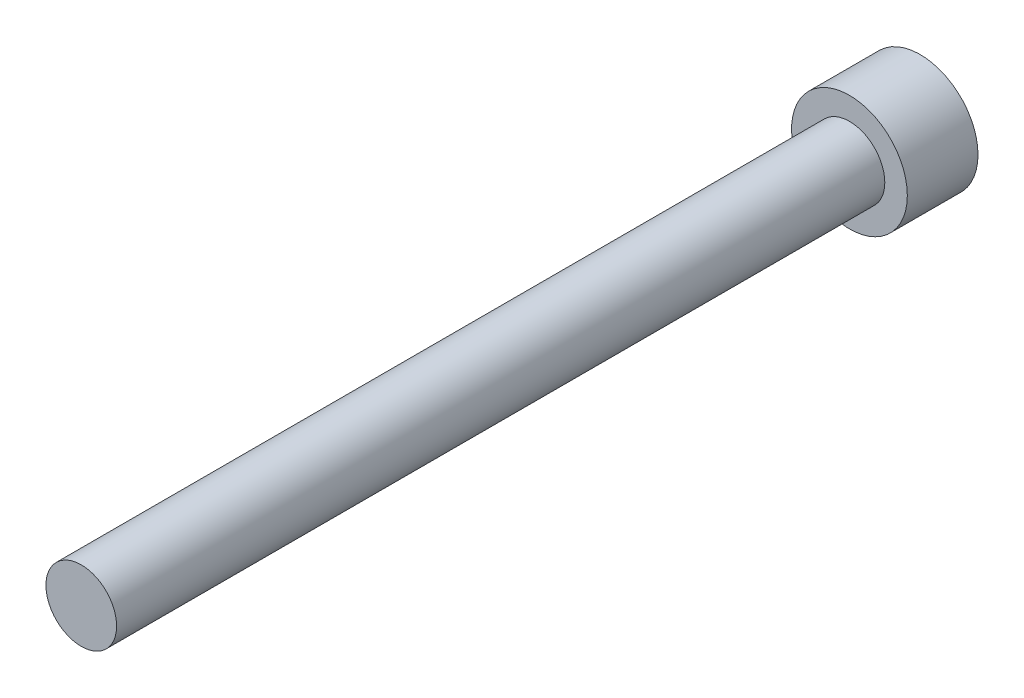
from build123d import *

# Parameters (mm, degrees)
HEX_2_DEPTH = 2.032


with BuildPart() as part:
    # Sketch6 → Revolve1 (revolve)
    with BuildSketch(Plane(origin=(0, 0, 0), x_dir=(0, 0, -1), z_dir=(1, 0, 0)), mode=Mode.PRIVATE) as revolve1_sk:
        Polygon((-38.1, 0), (-38.1, -1.7526), (0, -1.7526), (0, -2.8702), (3.5052, -2.8702), (3.5052, 0), align=None)
    revolve(revolve1_sk.sketch.rotate(Axis((0, 0, 38.1), (0, 0, -1)), 270), axis=Axis((0, 0, 38.1), (0, 0, -1)))

    # Sketch7 → HEX 2 (cut)
    with BuildSketch(Plane(origin=(0, 0, -3.5052), x_dir=(-1, 0, 0), z_dir=(0, 0, -1))):
        Polygon((-1.3843, 0.799225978), (-1.3843, -0.799225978), (0, -1.598451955), (1.3843, -0.799225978), (1.3843, 0.799225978), (0, 1.598451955), align=None)
    extrude(amount=-HEX_2_DEPTH, mode=Mode.SUBTRACT)


solid = part.part
